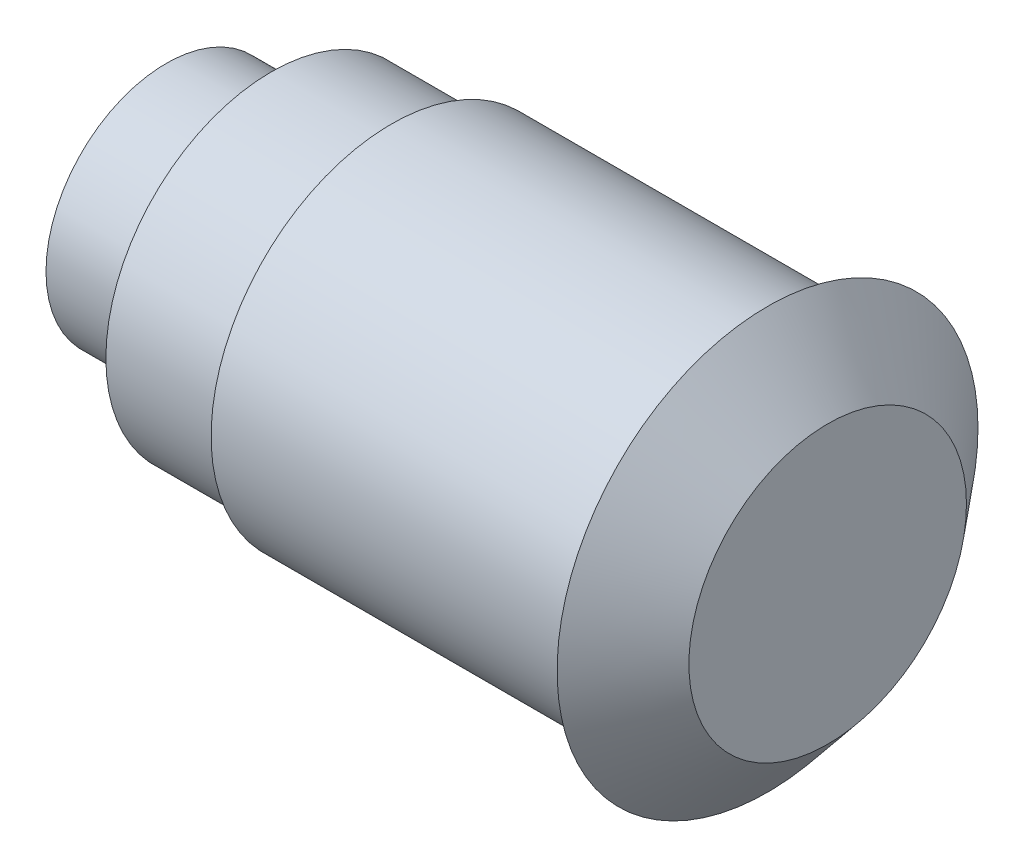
ISO-10303-21;
HEADER;
FILE_DESCRIPTION(('STEP AP214'),'2;1');
FILE_NAME('part.step','',(''),(''),'','','');
FILE_SCHEMA(('AUTOMOTIVE_DESIGN { 1 0 10303 214 1 1 1 1 }'));
ENDSEC;
DATA;
#1=APPLICATION_CONTEXT('core data for automotive mechanical design processes');
#2=APPLICATION_PROTOCOL_DEFINITION('international standard','automotive_design',2000,#1);
#3=PRODUCT_CONTEXT('',#1,'mechanical');
#4=PRODUCT('Part','Part','',(#3));
#5=PRODUCT_RELATED_PRODUCT_CATEGORY('part','',(#4));
#6=PRODUCT_DEFINITION_FORMATION('','',#4);
#7=PRODUCT_DEFINITION_CONTEXT('part definition',#1,'design');
#8=PRODUCT_DEFINITION('design','',#6,#7);
#9=PRODUCT_DEFINITION_SHAPE('','',#8);
#10=(LENGTH_UNIT() NAMED_UNIT(*) SI_UNIT(.MILLI.,.METRE.));
#11=(NAMED_UNIT(*) PLANE_ANGLE_UNIT() SI_UNIT($,.RADIAN.));
#12=(NAMED_UNIT(*) SI_UNIT($,.STERADIAN.) SOLID_ANGLE_UNIT());
#13=UNCERTAINTY_MEASURE_WITH_UNIT(LENGTH_MEASURE(1.E-05),#10,'distance_accuracy_value','');
#14=(GEOMETRIC_REPRESENTATION_CONTEXT(3) GLOBAL_UNCERTAINTY_ASSIGNED_CONTEXT((#13)) GLOBAL_UNIT_ASSIGNED_CONTEXT((#10,
#11,#12)) REPRESENTATION_CONTEXT('',''));
#15=CARTESIAN_POINT('',(0.,0.,0.));
#16=DIRECTION('',(0.,0.,1.));
#17=DIRECTION('',(1.,0.,0.));
#18=AXIS2_PLACEMENT_3D('',#15,#16,#17);
#19=CARTESIAN_POINT('',(2.,0.,0.));
#20=DIRECTION('',(1.,0.,0.));
#21=DIRECTION('',(0.,0.,-1.));
#22=AXIS2_PLACEMENT_3D('',#19,#20,#21);
#23=PLANE('',#22);
#24=CARTESIAN_POINT('',(2.,0.,0.));
#25=DIRECTION('',(1.,0.,0.));
#26=DIRECTION('',(0.,0.,-1.));
#27=AXIS2_PLACEMENT_3D('',#24,#25,#26);
#28=CIRCLE('',#27,4.61649281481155);
#29=CARTESIAN_POINT('',(2.,0.,-4.61649281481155));
#30=VERTEX_POINT('',#29);
#31=EDGE_CURVE('E10',#30,#30,#28,.T.);
#32=ORIENTED_EDGE('',*,*,#31,.T.);
#33=EDGE_LOOP('',(#32));
#34=FACE_BOUND('',#33,.T.);
#35=ADVANCED_FACE('F31',(#34),#23,.T.);
#36=CARTESIAN_POINT('',(2.,0.,0.));
#37=DIRECTION('',(-1.,0.,0.));
#38=DIRECTION('',(0.,0.,1.));
#39=AXIS2_PLACEMENT_3D('',#36,#37,#38);
#40=CONICAL_SURFACE('',#39,4.61649281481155,0.87266462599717);
#41=CARTESIAN_POINT('',(0.,0.,0.));
#42=DIRECTION('',(1.,0.,0.));
#43=DIRECTION('',(0.,0.,-1.));
#44=AXIS2_PLACEMENT_3D('',#41,#42,#43);
#45=CIRCLE('',#44,7.);
#46=CARTESIAN_POINT('',(0.,0.,-7.));
#47=VERTEX_POINT('',#46);
#48=EDGE_CURVE('E37',#47,#47,#45,.T.);
#49=ORIENTED_EDGE('',*,*,#48,.T.);
#50=EDGE_LOOP('',(#49));
#51=FACE_BOUND('',#50,.T.);
#52=ORIENTED_EDGE('',*,*,#31,.F.);
#53=EDGE_LOOP('',(#52));
#54=FACE_BOUND('',#53,.T.);
#55=ADVANCED_FACE('F81',(#51,#54),#40,.T.);
#56=CARTESIAN_POINT('',(0.,7.,0.));
#57=DIRECTION('',(-1.,0.,0.));
#58=DIRECTION('',(0.,0.,1.));
#59=AXIS2_PLACEMENT_3D('',#56,#57,#58);
#60=PLANE('',#59);
#61=CARTESIAN_POINT('',(0.,0.,0.));
#62=DIRECTION('',(1.,0.,0.));
#63=DIRECTION('',(0.,0.,-1.));
#64=AXIS2_PLACEMENT_3D('',#61,#62,#63);
#65=CIRCLE('',#64,6.);
#66=CARTESIAN_POINT('',(0.,0.,-6.));
#67=VERTEX_POINT('',#66);
#68=EDGE_CURVE('E41',#67,#67,#65,.T.);
#69=ORIENTED_EDGE('',*,*,#68,.T.);
#70=EDGE_LOOP('',(#69));
#71=FACE_BOUND('',#70,.T.);
#72=ORIENTED_EDGE('',*,*,#48,.F.);
#73=EDGE_LOOP('',(#72));
#74=FACE_BOUND('',#73,.T.);
#75=ADVANCED_FACE('F85',(#71,#74),#60,.T.);
#76=CARTESIAN_POINT('',(0.,0.,0.));
#77=DIRECTION('',(1.,0.,0.));
#78=DIRECTION('',(0.,0.,-1.));
#79=AXIS2_PLACEMENT_3D('',#76,#77,#78);
#80=CYLINDRICAL_SURFACE('',#79,6.);
#81=CARTESIAN_POINT('',(-12.50839595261,0.,0.));
#82=DIRECTION('',(1.,0.,0.));
#83=DIRECTION('',(0.,0.,-1.));
#84=AXIS2_PLACEMENT_3D('',#81,#82,#83);
#85=CIRCLE('',#84,6.);
#86=CARTESIAN_POINT('',(-12.50839595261,0.,-6.));
#87=VERTEX_POINT('',#86);
#88=EDGE_CURVE('E45',#87,#87,#85,.T.);
#89=ORIENTED_EDGE('',*,*,#88,.T.);
#90=EDGE_LOOP('',(#89));
#91=FACE_BOUND('',#90,.T.);
#92=ORIENTED_EDGE('',*,*,#68,.F.);
#93=EDGE_LOOP('',(#92));
#94=FACE_BOUND('',#93,.T.);
#95=ADVANCED_FACE('F89',(#91,#94),#80,.T.);
#96=CARTESIAN_POINT('',(-12.50839595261,0.,0.));
#97=DIRECTION('',(1.,0.,0.));
#98=DIRECTION('',(0.,0.,-1.));
#99=AXIS2_PLACEMENT_3D('',#96,#97,#98);
#100=CONICAL_SURFACE('',#99,6.,1.18357204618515);
#101=CARTESIAN_POINT('',(-12.7123028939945,0.,0.));
#102=DIRECTION('',(1.,0.,0.));
#103=DIRECTION('',(0.,0.,-1.));
#104=AXIS2_PLACEMENT_3D('',#101,#102,#103);
#105=CIRCLE('',#104,5.5);
#106=CARTESIAN_POINT('',(-12.7123028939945,0.,-5.5));
#107=VERTEX_POINT('',#106);
#108=EDGE_CURVE('E50',#107,#107,#105,.T.);
#109=ORIENTED_EDGE('',*,*,#108,.T.);
#110=EDGE_LOOP('',(#109));
#111=FACE_BOUND('',#110,.T.);
#112=ORIENTED_EDGE('',*,*,#88,.F.);
#113=EDGE_LOOP('',(#112));
#114=FACE_BOUND('',#113,.T.);
#115=ADVANCED_FACE('F96',(#111,#114),#100,.T.);
#116=CARTESIAN_POINT('',(0.,0.,0.));
#117=DIRECTION('',(1.,0.,0.));
#118=DIRECTION('',(0.,0.,-1.));
#119=AXIS2_PLACEMENT_3D('',#116,#117,#118);
#120=CYLINDRICAL_SURFACE('',#119,5.5);
#121=CARTESIAN_POINT('',(-16.50839595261,0.,0.));
#122=DIRECTION('',(1.,0.,0.));
#123=DIRECTION('',(0.,0.,-1.));
#124=AXIS2_PLACEMENT_3D('',#121,#122,#123);
#125=CIRCLE('',#124,5.5);
#126=CARTESIAN_POINT('',(-16.50839595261,0.,-5.5));
#127=VERTEX_POINT('',#126);
#128=EDGE_CURVE('E53',#127,#127,#125,.T.);
#129=ORIENTED_EDGE('',*,*,#128,.T.);
#130=EDGE_LOOP('',(#129));
#131=FACE_BOUND('',#130,.T.);
#132=ORIENTED_EDGE('',*,*,#108,.F.);
#133=EDGE_LOOP('',(#132));
#134=FACE_BOUND('',#133,.T.);
#135=ADVANCED_FACE('F100',(#131,#134),#120,.T.);
#136=CARTESIAN_POINT('',(-16.50839595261,0.,0.));
#137=DIRECTION('',(1.,0.,0.));
#138=DIRECTION('',(0.,0.,-1.));
#139=AXIS2_PLACEMENT_3D('',#136,#137,#138);
#140=CONICAL_SURFACE('',#139,5.5,1.18357204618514);
#141=CARTESIAN_POINT('',(-17.1201167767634,0.,0.));
#142=DIRECTION('',(1.,0.,0.));
#143=DIRECTION('',(0.,0.,-1.));
#144=AXIS2_PLACEMENT_3D('',#141,#142,#143);
#145=CIRCLE('',#144,4.);
#146=CARTESIAN_POINT('',(-17.1201167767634,0.,-4.));
#147=VERTEX_POINT('',#146);
#148=EDGE_CURVE('E56',#147,#147,#145,.T.);
#149=ORIENTED_EDGE('',*,*,#148,.T.);
#150=EDGE_LOOP('',(#149));
#151=FACE_BOUND('',#150,.T.);
#152=ORIENTED_EDGE('',*,*,#128,.F.);
#153=EDGE_LOOP('',(#152));
#154=FACE_BOUND('',#153,.T.);
#155=ADVANCED_FACE('F104',(#151,#154),#140,.T.);
#156=CARTESIAN_POINT('',(0.,0.,0.));
#157=DIRECTION('',(1.,0.,0.));
#158=DIRECTION('',(0.,0.,-1.));
#159=AXIS2_PLACEMENT_3D('',#156,#157,#158);
#160=CYLINDRICAL_SURFACE('',#159,4.);
#161=CARTESIAN_POINT('',(-20.,0.,0.));
#162=DIRECTION('',(1.,0.,0.));
#163=DIRECTION('',(0.,0.,-1.));
#164=AXIS2_PLACEMENT_3D('',#161,#162,#163);
#165=CIRCLE('',#164,4.);
#166=CARTESIAN_POINT('',(-20.,0.,-4.));
#167=VERTEX_POINT('',#166);
#168=EDGE_CURVE('E59',#167,#167,#165,.T.);
#169=ORIENTED_EDGE('',*,*,#168,.T.);
#170=EDGE_LOOP('',(#169));
#171=FACE_BOUND('',#170,.T.);
#172=ORIENTED_EDGE('',*,*,#148,.F.);
#173=EDGE_LOOP('',(#172));
#174=FACE_BOUND('',#173,.T.);
#175=ADVANCED_FACE('F108',(#171,#174),#160,.T.);
#176=CARTESIAN_POINT('',(-20.,4.,0.));
#177=DIRECTION('',(-1.,0.,0.));
#178=DIRECTION('',(0.,0.,1.));
#179=AXIS2_PLACEMENT_3D('',#176,#177,#178);
#180=PLANE('',#179);
#181=CARTESIAN_POINT('',(-20.,0.,0.));
#182=DIRECTION('',(1.,0.,0.));
#183=DIRECTION('',(0.,0.,-1.));
#184=AXIS2_PLACEMENT_3D('',#181,#182,#183);
#185=CIRCLE('',#184,2.84268537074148);
#186=CARTESIAN_POINT('',(-20.,0.,-2.84268537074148));
#187=VERTEX_POINT('',#186);
#188=EDGE_CURVE('E62',#187,#187,#185,.T.);
#189=ORIENTED_EDGE('',*,*,#188,.T.);
#190=EDGE_LOOP('',(#189));
#191=FACE_BOUND('',#190,.T.);
#192=ORIENTED_EDGE('',*,*,#168,.F.);
#193=EDGE_LOOP('',(#192));
#194=FACE_BOUND('',#193,.T.);
#195=ADVANCED_FACE('F78',(#191,#194),#180,.T.);
#196=CARTESIAN_POINT('',(0.,0.,0.));
#197=DIRECTION('',(1.,0.,0.));
#198=DIRECTION('',(0.,0.,-1.));
#199=AXIS2_PLACEMENT_3D('',#196,#197,#198);
#200=CYLINDRICAL_SURFACE('',#199,2.84268537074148);
#201=CARTESIAN_POINT('',(-17.1201167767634,0.,0.));
#202=DIRECTION('',(1.,0.,0.));
#203=DIRECTION('',(0.,0.,-1.));
#204=AXIS2_PLACEMENT_3D('',#201,#202,#203);
#205=CIRCLE('',#204,2.84268537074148);
#206=CARTESIAN_POINT('',(-17.1201167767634,0.,-2.84268537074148));
#207=VERTEX_POINT('',#206);
#208=EDGE_CURVE('E65',#207,#207,#205,.T.);
#209=ORIENTED_EDGE('',*,*,#208,.T.);
#210=EDGE_LOOP('',(#209));
#211=FACE_BOUND('',#210,.T.);
#212=ORIENTED_EDGE('',*,*,#188,.F.);
#213=EDGE_LOOP('',(#212));
#214=FACE_BOUND('',#213,.T.);
#215=ADVANCED_FACE('F69',(#211,#214),#200,.F.);
#216=CARTESIAN_POINT('',(-17.1201167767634,2.84268537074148,0.));
#217=DIRECTION('',(-1.,0.,0.));
#218=DIRECTION('',(0.,0.,1.));
#219=AXIS2_PLACEMENT_3D('',#216,#217,#218);
#220=PLANE('',#219);
#221=ORIENTED_EDGE('',*,*,#208,.F.);
#222=EDGE_LOOP('',(#221));
#223=FACE_BOUND('',#222,.T.);
#224=ADVANCED_FACE('F72',(#223),#220,.T.);
#225=CLOSED_SHELL('',(#35,#55,#75,#95,#115,#135,#155,#175,#195,#215,#224));
#226=MANIFOLD_SOLID_BREP('B2',#225);
#227=ADVANCED_BREP_SHAPE_REPRESENTATION('',(#18,#226),#14);
#228=SHAPE_DEFINITION_REPRESENTATION(#9,#227);
ENDSEC;
END-ISO-10303-21;
